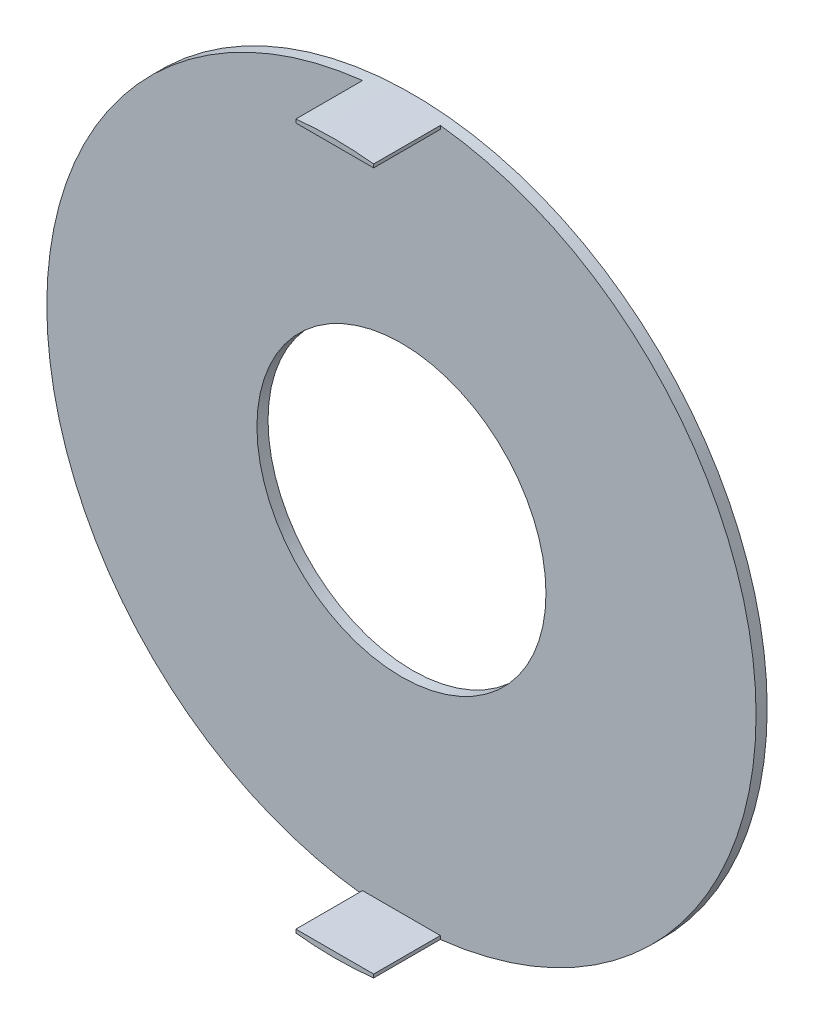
from build123d import *

# Parameters (mm, degrees)
ESQUISSE1_R                  = 15.95
ESQUISSE1_R_2                = 6.5
EXTRUSION1_DEPTH             = 0.5
EXTRUSION2_DEPTH             = 3
R_P_TITION_CIRCULAIRE1_COUNT = 2


with BuildPart() as part:
    # Esquisse1 → Extrusion1 (new body)
    with BuildSketch(Plane.XY):
        Circle(ESQUISSE1_R)
        Circle(ESQUISSE1_R_2, mode=Mode.SUBTRACT)
    extrude(amount=EXTRUSION1_DEPTH)

    # Esquisse2 → Extrusion2 (add)
    with BuildSketch(Plane.XY.offset(0.5)):
        with BuildLine():
            Line((-1.75, 15.853706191), (-1.75, 15.7))
            Line((-1.75, 15.7), (1.75, 15.7))
            Line((1.75, 15.7), (1.75, 15.853706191))
            ThreePointArc((1.75, 15.853706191), (0, 15.95), (-1.75, 15.853706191))
        make_face()
    extrusion2 = extrude(amount=EXTRUSION2_DEPTH)

    # R_p_tition circulaire1: Extrusion2 ×2 about axis
    r_p_tition_circulaire1_axis = Axis((0, 0, 0), (0, 0, 1))
    for i in range(1, R_P_TITION_CIRCULAIRE1_COUNT):
        add(extrusion2.rotate(r_p_tition_circulaire1_axis, i * 360 / R_P_TITION_CIRCULAIRE1_COUNT))


solid = part.part
